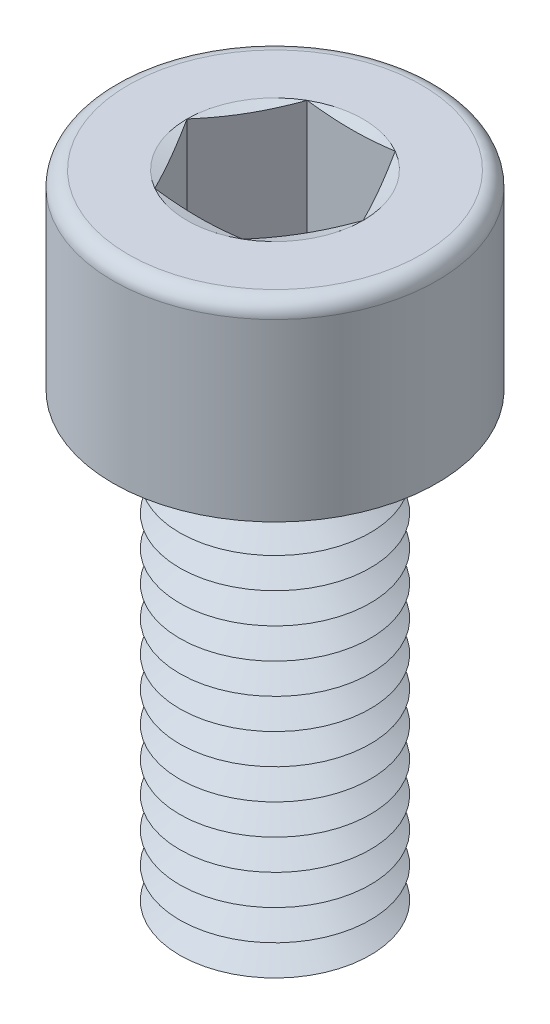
ISO-10303-21;
HEADER;
FILE_DESCRIPTION(('STEP AP214'),'2;1');
FILE_NAME('part.step','',(''),(''),'','','');
FILE_SCHEMA(('AUTOMOTIVE_DESIGN { 1 0 10303 214 1 1 1 1 }'));
ENDSEC;
DATA;
#1=APPLICATION_CONTEXT('core data for automotive mechanical design processes');
#2=APPLICATION_PROTOCOL_DEFINITION('international standard','automotive_design',2000,#1);
#3=PRODUCT_CONTEXT('',#1,'mechanical');
#4=PRODUCT('Part','Part','',(#3));
#5=PRODUCT_RELATED_PRODUCT_CATEGORY('part','',(#4));
#6=PRODUCT_DEFINITION_FORMATION('','',#4);
#7=PRODUCT_DEFINITION_CONTEXT('part definition',#1,'design');
#8=PRODUCT_DEFINITION('design','',#6,#7);
#9=PRODUCT_DEFINITION_SHAPE('','',#8);
#10=(LENGTH_UNIT() NAMED_UNIT(*) SI_UNIT(.MILLI.,.METRE.));
#11=(NAMED_UNIT(*) PLANE_ANGLE_UNIT() SI_UNIT($,.RADIAN.));
#12=(NAMED_UNIT(*) SI_UNIT($,.STERADIAN.) SOLID_ANGLE_UNIT());
#13=UNCERTAINTY_MEASURE_WITH_UNIT(LENGTH_MEASURE(1.E-05),#10,'distance_accuracy_value','');
#14=(GEOMETRIC_REPRESENTATION_CONTEXT(3) GLOBAL_UNCERTAINTY_ASSIGNED_CONTEXT((#13)) GLOBAL_UNIT_ASSIGNED_CONTEXT((#10,
#11,#12)) REPRESENTATION_CONTEXT('',''));
#15=CARTESIAN_POINT('',(0.,0.,0.));
#16=DIRECTION('',(0.,0.,1.));
#17=DIRECTION('',(1.,0.,0.));
#18=AXIS2_PLACEMENT_3D('',#15,#16,#17);
#19=CARTESIAN_POINT('',(0.,3.2,0.));
#20=DIRECTION('',(0.,1.,0.));
#21=DIRECTION('',(0.,0.,1.));
#22=AXIS2_PLACEMENT_3D('',#19,#20,#21);
#23=CONICAL_SURFACE('',#22,1.80717967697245,1.0471975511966);
#24=CARTESIAN_POINT('',(0.,3.6,0.));
#25=DIRECTION('',(0.,1.,0.));
#26=DIRECTION('',(0.,0.,1.));
#27=AXIS2_PLACEMENT_3D('',#24,#25,#26);
#28=CIRCLE('',#27,2.5);
#29=CARTESIAN_POINT('',(0.,3.6,2.5));
#30=VERTEX_POINT('',#29);
#31=EDGE_CURVE('E428',#30,#30,#28,.T.);
#32=ORIENTED_EDGE('',*,*,#31,.F.);
#33=EDGE_LOOP('',(#32));
#34=FACE_BOUND('',#33,.T.);
#35=CARTESIAN_POINT('',(0.,3.2,0.));
#36=DIRECTION('',(0.,1.,0.));
#37=DIRECTION('',(0.,0.,1.));
#38=AXIS2_PLACEMENT_3D('',#35,#36,#37);
#39=CIRCLE('',#38,1.80717967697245);
#40=CARTESIAN_POINT('',(0.,3.2,1.80717967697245));
#41=VERTEX_POINT('',#40);
#42=EDGE_CURVE('E432',#41,#41,#39,.T.);
#43=ORIENTED_EDGE('',*,*,#42,.T.);
#44=EDGE_LOOP('',(#43));
#45=FACE_BOUND('',#44,.T.);
#46=ADVANCED_FACE('F41',(#34,#45),#23,.T.);
#47=CARTESIAN_POINT('',(0.,2.8,0.));
#48=DIRECTION('',(0.,-1.,0.));
#49=DIRECTION('',(0.,0.,-1.));
#50=AXIS2_PLACEMENT_3D('',#47,#48,#49);
#51=CONICAL_SURFACE('',#50,2.5,1.0471975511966);
#52=ORIENTED_EDGE('',*,*,#42,.F.);
#53=EDGE_LOOP('',(#52));
#54=FACE_BOUND('',#53,.T.);
#55=CARTESIAN_POINT('',(0.,2.8,0.));
#56=DIRECTION('',(0.,1.,0.));
#57=DIRECTION('',(0.,0.,1.));
#58=AXIS2_PLACEMENT_3D('',#55,#56,#57);
#59=CIRCLE('',#58,2.5);
#60=CARTESIAN_POINT('',(0.,2.8,2.5));
#61=VERTEX_POINT('',#60);
#62=EDGE_CURVE('E436',#61,#61,#59,.T.);
#63=ORIENTED_EDGE('',*,*,#62,.T.);
#64=EDGE_LOOP('',(#63));
#65=FACE_BOUND('',#64,.T.);
#66=ADVANCED_FACE('F251',(#54,#65),#51,.T.);
#67=CARTESIAN_POINT('',(0.,0.,0.));
#68=DIRECTION('',(0.,1.,0.));
#69=DIRECTION('',(0.,0.,1.));
#70=AXIS2_PLACEMENT_3D('',#67,#68,#69);
#71=PLANE('',#70);
#72=CARTESIAN_POINT('',(0.,0.,0.));
#73=DIRECTION('',(0.,1.,0.));
#74=DIRECTION('',(0.,0.,1.));
#75=AXIS2_PLACEMENT_3D('',#72,#73,#74);
#76=CIRCLE('',#75,1.80717967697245);
#77=CARTESIAN_POINT('',(0.,0.,1.80717967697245));
#78=VERTEX_POINT('',#77);
#79=EDGE_CURVE('E464',#78,#78,#76,.T.);
#80=ORIENTED_EDGE('',*,*,#79,.F.);
#81=EDGE_LOOP('',(#80));
#82=FACE_BOUND('',#81,.T.);
#83=ADVANCED_FACE('F248',(#82),#71,.F.);
#84=CARTESIAN_POINT('',(0.,0.,0.));
#85=DIRECTION('',(0.,1.,0.));
#86=DIRECTION('',(0.,0.,1.));
#87=AXIS2_PLACEMENT_3D('',#84,#85,#86);
#88=CONICAL_SURFACE('',#87,1.80717967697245,1.0471975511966);
#89=CARTESIAN_POINT('',(0.,0.400000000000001,0.));
#90=DIRECTION('',(0.,1.,0.));
#91=DIRECTION('',(0.,0.,1.));
#92=AXIS2_PLACEMENT_3D('',#89,#90,#91);
#93=CIRCLE('',#92,2.5);
#94=CARTESIAN_POINT('',(0.,0.400000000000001,2.5));
#95=VERTEX_POINT('',#94);
#96=EDGE_CURVE('E460',#95,#95,#93,.T.);
#97=ORIENTED_EDGE('',*,*,#96,.F.);
#98=EDGE_LOOP('',(#97));
#99=FACE_BOUND('',#98,.T.);
#100=ORIENTED_EDGE('',*,*,#79,.T.);
#101=EDGE_LOOP('',(#100));
#102=FACE_BOUND('',#101,.T.);
#103=ADVANCED_FACE('F250',(#99,#102),#88,.T.);
#104=CARTESIAN_POINT('',(0.,0.400000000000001,0.));
#105=DIRECTION('',(0.,-1.,0.));
#106=DIRECTION('',(0.,0.,-1.));
#107=AXIS2_PLACEMENT_3D('',#104,#105,#106);
#108=CONICAL_SURFACE('',#107,2.5,1.0471975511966);
#109=CARTESIAN_POINT('',(0.,0.8,0.));
#110=DIRECTION('',(0.,1.,0.));
#111=DIRECTION('',(0.,0.,1.));
#112=AXIS2_PLACEMENT_3D('',#109,#110,#111);
#113=CIRCLE('',#112,1.80717967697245);
#114=CARTESIAN_POINT('',(0.,0.8,1.80717967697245));
#115=VERTEX_POINT('',#114);
#116=EDGE_CURVE('E456',#115,#115,#113,.T.);
#117=ORIENTED_EDGE('',*,*,#116,.F.);
#118=EDGE_LOOP('',(#117));
#119=FACE_BOUND('',#118,.T.);
#120=ORIENTED_EDGE('',*,*,#96,.T.);
#121=EDGE_LOOP('',(#120));
#122=FACE_BOUND('',#121,.T.);
#123=ADVANCED_FACE('F291',(#119,#122),#108,.T.);
#124=CARTESIAN_POINT('',(0.,0.8,0.));
#125=DIRECTION('',(0.,1.,0.));
#126=DIRECTION('',(0.,0.,1.));
#127=AXIS2_PLACEMENT_3D('',#124,#125,#126);
#128=CONICAL_SURFACE('',#127,1.80717967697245,1.0471975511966);
#129=CARTESIAN_POINT('',(0.,1.2,0.));
#130=DIRECTION('',(0.,1.,0.));
#131=DIRECTION('',(0.,0.,1.));
#132=AXIS2_PLACEMENT_3D('',#129,#130,#131);
#133=CIRCLE('',#132,2.5);
#134=CARTESIAN_POINT('',(0.,1.2,2.5));
#135=VERTEX_POINT('',#134);
#136=EDGE_CURVE('E452',#135,#135,#133,.T.);
#137=ORIENTED_EDGE('',*,*,#136,.F.);
#138=EDGE_LOOP('',(#137));
#139=FACE_BOUND('',#138,.T.);
#140=ORIENTED_EDGE('',*,*,#116,.T.);
#141=EDGE_LOOP('',(#140));
#142=FACE_BOUND('',#141,.T.);
#143=ADVANCED_FACE('F286',(#139,#142),#128,.T.);
#144=CARTESIAN_POINT('',(0.,1.2,0.));
#145=DIRECTION('',(0.,-1.,0.));
#146=DIRECTION('',(0.,0.,-1.));
#147=AXIS2_PLACEMENT_3D('',#144,#145,#146);
#148=CONICAL_SURFACE('',#147,2.5,1.0471975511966);
#149=CARTESIAN_POINT('',(0.,1.6,0.));
#150=DIRECTION('',(0.,1.,0.));
#151=DIRECTION('',(0.,0.,1.));
#152=AXIS2_PLACEMENT_3D('',#149,#150,#151);
#153=CIRCLE('',#152,1.80717967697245);
#154=CARTESIAN_POINT('',(0.,1.6,1.80717967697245));
#155=VERTEX_POINT('',#154);
#156=EDGE_CURVE('E448',#155,#155,#153,.T.);
#157=ORIENTED_EDGE('',*,*,#156,.F.);
#158=EDGE_LOOP('',(#157));
#159=FACE_BOUND('',#158,.T.);
#160=ORIENTED_EDGE('',*,*,#136,.T.);
#161=EDGE_LOOP('',(#160));
#162=FACE_BOUND('',#161,.T.);
#163=ADVANCED_FACE('F283',(#159,#162),#148,.T.);
#164=CARTESIAN_POINT('',(0.,1.6,0.));
#165=DIRECTION('',(0.,1.,0.));
#166=DIRECTION('',(0.,0.,1.));
#167=AXIS2_PLACEMENT_3D('',#164,#165,#166);
#168=CONICAL_SURFACE('',#167,1.80717967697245,1.0471975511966);
#169=CARTESIAN_POINT('',(0.,2.,0.));
#170=DIRECTION('',(0.,1.,0.));
#171=DIRECTION('',(0.,0.,1.));
#172=AXIS2_PLACEMENT_3D('',#169,#170,#171);
#173=CIRCLE('',#172,2.5);
#174=CARTESIAN_POINT('',(0.,2.,2.5));
#175=VERTEX_POINT('',#174);
#176=EDGE_CURVE('E444',#175,#175,#173,.T.);
#177=ORIENTED_EDGE('',*,*,#176,.F.);
#178=EDGE_LOOP('',(#177));
#179=FACE_BOUND('',#178,.T.);
#180=ORIENTED_EDGE('',*,*,#156,.T.);
#181=EDGE_LOOP('',(#180));
#182=FACE_BOUND('',#181,.T.);
#183=ADVANCED_FACE('F277',(#179,#182),#168,.T.);
#184=CARTESIAN_POINT('',(0.,2.,0.));
#185=DIRECTION('',(0.,-1.,0.));
#186=DIRECTION('',(0.,0.,-1.));
#187=AXIS2_PLACEMENT_3D('',#184,#185,#186);
#188=CONICAL_SURFACE('',#187,2.5,1.0471975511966);
#189=CARTESIAN_POINT('',(0.,2.4,0.));
#190=DIRECTION('',(0.,1.,0.));
#191=DIRECTION('',(0.,0.,1.));
#192=AXIS2_PLACEMENT_3D('',#189,#190,#191);
#193=CIRCLE('',#192,1.80717967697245);
#194=CARTESIAN_POINT('',(0.,2.4,1.80717967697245));
#195=VERTEX_POINT('',#194);
#196=EDGE_CURVE('E440',#195,#195,#193,.T.);
#197=ORIENTED_EDGE('',*,*,#196,.F.);
#198=EDGE_LOOP('',(#197));
#199=FACE_BOUND('',#198,.T.);
#200=ORIENTED_EDGE('',*,*,#176,.T.);
#201=EDGE_LOOP('',(#200));
#202=FACE_BOUND('',#201,.T.);
#203=ADVANCED_FACE('F273',(#199,#202),#188,.T.);
#204=CARTESIAN_POINT('',(0.,2.4,0.));
#205=DIRECTION('',(0.,1.,0.));
#206=DIRECTION('',(0.,0.,1.));
#207=AXIS2_PLACEMENT_3D('',#204,#205,#206);
#208=CONICAL_SURFACE('',#207,1.80717967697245,1.0471975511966);
#209=ORIENTED_EDGE('',*,*,#62,.F.);
#210=EDGE_LOOP('',(#209));
#211=FACE_BOUND('',#210,.T.);
#212=ORIENTED_EDGE('',*,*,#196,.T.);
#213=EDGE_LOOP('',(#212));
#214=FACE_BOUND('',#213,.T.);
#215=ADVANCED_FACE('F276',(#211,#214),#208,.T.);
#216=CARTESIAN_POINT('',(0.,4.,0.));
#217=DIRECTION('',(0.,1.,0.));
#218=DIRECTION('',(0.,0.,1.));
#219=AXIS2_PLACEMENT_3D('',#216,#217,#218);
#220=CONICAL_SURFACE('',#219,1.80717967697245,1.0471975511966);
#221=CARTESIAN_POINT('',(0.,4.4,0.));
#222=DIRECTION('',(0.,1.,0.));
#223=DIRECTION('',(0.,0.,1.));
#224=AXIS2_PLACEMENT_3D('',#221,#222,#223);
#225=CIRCLE('',#224,2.5);
#226=CARTESIAN_POINT('',(0.,4.4,2.5));
#227=VERTEX_POINT('',#226);
#228=EDGE_CURVE('E420',#227,#227,#225,.T.);
#229=ORIENTED_EDGE('',*,*,#228,.F.);
#230=EDGE_LOOP('',(#229));
#231=FACE_BOUND('',#230,.T.);
#232=CARTESIAN_POINT('',(0.,4.,0.));
#233=DIRECTION('',(0.,1.,0.));
#234=DIRECTION('',(0.,0.,1.));
#235=AXIS2_PLACEMENT_3D('',#232,#233,#234);
#236=CIRCLE('',#235,1.80717967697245);
#237=CARTESIAN_POINT('',(0.,4.,1.80717967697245));
#238=VERTEX_POINT('',#237);
#239=EDGE_CURVE('E424',#238,#238,#236,.T.);
#240=ORIENTED_EDGE('',*,*,#239,.T.);
#241=EDGE_LOOP('',(#240));
#242=FACE_BOUND('',#241,.T.);
#243=ADVANCED_FACE('F281',(#231,#242),#220,.T.);
#244=CARTESIAN_POINT('',(0.,3.6,0.));
#245=DIRECTION('',(0.,-1.,0.));
#246=DIRECTION('',(0.,0.,-1.));
#247=AXIS2_PLACEMENT_3D('',#244,#245,#246);
#248=CONICAL_SURFACE('',#247,2.5,1.0471975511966);
#249=ORIENTED_EDGE('',*,*,#239,.F.);
#250=EDGE_LOOP('',(#249));
#251=FACE_BOUND('',#250,.T.);
#252=ORIENTED_EDGE('',*,*,#31,.T.);
#253=EDGE_LOOP('',(#252));
#254=FACE_BOUND('',#253,.T.);
#255=ADVANCED_FACE('F696',(#251,#254),#248,.T.);
#256=CARTESIAN_POINT('',(0.,4.8,0.));
#257=DIRECTION('',(0.,1.,0.));
#258=DIRECTION('',(0.,0.,1.));
#259=AXIS2_PLACEMENT_3D('',#256,#257,#258);
#260=CONICAL_SURFACE('',#259,1.80717967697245,1.0471975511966);
#261=CARTESIAN_POINT('',(0.,5.2,0.));
#262=DIRECTION('',(0.,1.,0.));
#263=DIRECTION('',(0.,0.,1.));
#264=AXIS2_PLACEMENT_3D('',#261,#262,#263);
#265=CIRCLE('',#264,2.5);
#266=CARTESIAN_POINT('',(0.,5.2,2.5));
#267=VERTEX_POINT('',#266);
#268=EDGE_CURVE('E413',#267,#267,#265,.T.);
#269=ORIENTED_EDGE('',*,*,#268,.F.);
#270=EDGE_LOOP('',(#269));
#271=FACE_BOUND('',#270,.T.);
#272=CARTESIAN_POINT('',(0.,4.8,0.));
#273=DIRECTION('',(0.,1.,0.));
#274=DIRECTION('',(0.,0.,1.));
#275=AXIS2_PLACEMENT_3D('',#272,#273,#274);
#276=CIRCLE('',#275,1.80717967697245);
#277=CARTESIAN_POINT('',(0.,4.8,1.80717967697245));
#278=VERTEX_POINT('',#277);
#279=EDGE_CURVE('E416',#278,#278,#276,.T.);
#280=ORIENTED_EDGE('',*,*,#279,.T.);
#281=EDGE_LOOP('',(#280));
#282=FACE_BOUND('',#281,.T.);
#283=ADVANCED_FACE('F705',(#271,#282),#260,.T.);
#284=CARTESIAN_POINT('',(0.,4.4,0.));
#285=DIRECTION('',(0.,-1.,0.));
#286=DIRECTION('',(0.,0.,-1.));
#287=AXIS2_PLACEMENT_3D('',#284,#285,#286);
#288=CONICAL_SURFACE('',#287,2.5,1.0471975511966);
#289=ORIENTED_EDGE('',*,*,#279,.F.);
#290=EDGE_LOOP('',(#289));
#291=FACE_BOUND('',#290,.T.);
#292=ORIENTED_EDGE('',*,*,#228,.T.);
#293=EDGE_LOOP('',(#292));
#294=FACE_BOUND('',#293,.T.);
#295=ADVANCED_FACE('F715',(#291,#294),#288,.T.);
#296=CARTESIAN_POINT('',(0.,5.6,0.));
#297=DIRECTION('',(0.,1.,0.));
#298=DIRECTION('',(0.,0.,1.));
#299=AXIS2_PLACEMENT_3D('',#296,#297,#298);
#300=CONICAL_SURFACE('',#299,1.80717967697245,1.0471975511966);
#301=CARTESIAN_POINT('',(0.,6.,0.));
#302=DIRECTION('',(0.,1.,0.));
#303=DIRECTION('',(0.,0.,1.));
#304=AXIS2_PLACEMENT_3D('',#301,#302,#303);
#305=CIRCLE('',#304,2.5);
#306=CARTESIAN_POINT('',(0.,6.,2.5));
#307=VERTEX_POINT('',#306);
#308=EDGE_CURVE('E405',#307,#307,#305,.T.);
#309=ORIENTED_EDGE('',*,*,#308,.F.);
#310=EDGE_LOOP('',(#309));
#311=FACE_BOUND('',#310,.T.);
#312=CARTESIAN_POINT('',(0.,5.6,0.));
#313=DIRECTION('',(0.,1.,0.));
#314=DIRECTION('',(0.,0.,1.));
#315=AXIS2_PLACEMENT_3D('',#312,#313,#314);
#316=CIRCLE('',#315,1.80717967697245);
#317=CARTESIAN_POINT('',(0.,5.6,1.80717967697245));
#318=VERTEX_POINT('',#317);
#319=EDGE_CURVE('E409',#318,#318,#316,.T.);
#320=ORIENTED_EDGE('',*,*,#319,.T.);
#321=EDGE_LOOP('',(#320));
#322=FACE_BOUND('',#321,.T.);
#323=ADVANCED_FACE('F725',(#311,#322),#300,.T.);
#324=CARTESIAN_POINT('',(0.,5.2,0.));
#325=DIRECTION('',(0.,-1.,0.));
#326=DIRECTION('',(0.,0.,-1.));
#327=AXIS2_PLACEMENT_3D('',#324,#325,#326);
#328=CONICAL_SURFACE('',#327,2.5,1.0471975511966);
#329=ORIENTED_EDGE('',*,*,#319,.F.);
#330=EDGE_LOOP('',(#329));
#331=FACE_BOUND('',#330,.T.);
#332=ORIENTED_EDGE('',*,*,#268,.T.);
#333=EDGE_LOOP('',(#332));
#334=FACE_BOUND('',#333,.T.);
#335=ADVANCED_FACE('F735',(#331,#334),#328,.T.);
#336=CARTESIAN_POINT('',(0.,6.4,0.));
#337=DIRECTION('',(0.,1.,0.));
#338=DIRECTION('',(0.,0.,1.));
#339=AXIS2_PLACEMENT_3D('',#336,#337,#338);
#340=CONICAL_SURFACE('',#339,1.80717967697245,1.0471975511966);
#341=CARTESIAN_POINT('',(0.,6.8,0.));
#342=DIRECTION('',(0.,1.,0.));
#343=DIRECTION('',(0.,0.,1.));
#344=AXIS2_PLACEMENT_3D('',#341,#342,#343);
#345=CIRCLE('',#344,2.5);
#346=CARTESIAN_POINT('',(0.,6.8,2.5));
#347=VERTEX_POINT('',#346);
#348=EDGE_CURVE('E397',#347,#347,#345,.T.);
#349=ORIENTED_EDGE('',*,*,#348,.F.);
#350=EDGE_LOOP('',(#349));
#351=FACE_BOUND('',#350,.T.);
#352=CARTESIAN_POINT('',(0.,6.4,0.));
#353=DIRECTION('',(0.,1.,0.));
#354=DIRECTION('',(0.,0.,1.));
#355=AXIS2_PLACEMENT_3D('',#352,#353,#354);
#356=CIRCLE('',#355,1.80717967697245);
#357=CARTESIAN_POINT('',(0.,6.4,1.80717967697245));
#358=VERTEX_POINT('',#357);
#359=EDGE_CURVE('E401',#358,#358,#356,.T.);
#360=ORIENTED_EDGE('',*,*,#359,.T.);
#361=EDGE_LOOP('',(#360));
#362=FACE_BOUND('',#361,.T.);
#363=ADVANCED_FACE('F745',(#351,#362),#340,.T.);
#364=CARTESIAN_POINT('',(0.,6.,0.));
#365=DIRECTION('',(0.,-1.,0.));
#366=DIRECTION('',(0.,0.,-1.));
#367=AXIS2_PLACEMENT_3D('',#364,#365,#366);
#368=CONICAL_SURFACE('',#367,2.5,1.0471975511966);
#369=ORIENTED_EDGE('',*,*,#359,.F.);
#370=EDGE_LOOP('',(#369));
#371=FACE_BOUND('',#370,.T.);
#372=ORIENTED_EDGE('',*,*,#308,.T.);
#373=EDGE_LOOP('',(#372));
#374=FACE_BOUND('',#373,.T.);
#375=ADVANCED_FACE('F755',(#371,#374),#368,.T.);
#376=CARTESIAN_POINT('',(0.,7.2,0.));
#377=DIRECTION('',(0.,1.,0.));
#378=DIRECTION('',(0.,0.,1.));
#379=AXIS2_PLACEMENT_3D('',#376,#377,#378);
#380=CONICAL_SURFACE('',#379,1.80717967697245,1.0471975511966);
#381=CARTESIAN_POINT('',(0.,7.6,0.));
#382=DIRECTION('',(0.,1.,0.));
#383=DIRECTION('',(0.,0.,1.));
#384=AXIS2_PLACEMENT_3D('',#381,#382,#383);
#385=CIRCLE('',#384,2.5);
#386=CARTESIAN_POINT('',(0.,7.6,2.5));
#387=VERTEX_POINT('',#386);
#388=EDGE_CURVE('E390',#387,#387,#385,.T.);
#389=ORIENTED_EDGE('',*,*,#388,.F.);
#390=EDGE_LOOP('',(#389));
#391=FACE_BOUND('',#390,.T.);
#392=CARTESIAN_POINT('',(0.,7.2,0.));
#393=DIRECTION('',(0.,1.,0.));
#394=DIRECTION('',(0.,0.,1.));
#395=AXIS2_PLACEMENT_3D('',#392,#393,#394);
#396=CIRCLE('',#395,1.80717967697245);
#397=CARTESIAN_POINT('',(0.,7.2,1.80717967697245));
#398=VERTEX_POINT('',#397);
#399=EDGE_CURVE('E394',#398,#398,#396,.T.);
#400=ORIENTED_EDGE('',*,*,#399,.T.);
#401=EDGE_LOOP('',(#400));
#402=FACE_BOUND('',#401,.T.);
#403=ADVANCED_FACE('F765',(#391,#402),#380,.T.);
#404=CARTESIAN_POINT('',(0.,6.8,0.));
#405=DIRECTION('',(0.,-1.,0.));
#406=DIRECTION('',(0.,0.,-1.));
#407=AXIS2_PLACEMENT_3D('',#404,#405,#406);
#408=CONICAL_SURFACE('',#407,2.5,1.0471975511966);
#409=ORIENTED_EDGE('',*,*,#399,.F.);
#410=EDGE_LOOP('',(#409));
#411=FACE_BOUND('',#410,.T.);
#412=ORIENTED_EDGE('',*,*,#348,.T.);
#413=EDGE_LOOP('',(#412));
#414=FACE_BOUND('',#413,.T.);
#415=ADVANCED_FACE('F775',(#411,#414),#408,.T.);
#416=CARTESIAN_POINT('',(0.,8.,0.));
#417=DIRECTION('',(0.,1.,0.));
#418=DIRECTION('',(0.,0.,1.));
#419=AXIS2_PLACEMENT_3D('',#416,#417,#418);
#420=CONICAL_SURFACE('',#419,1.80717967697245,1.0471975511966);
#421=CARTESIAN_POINT('',(0.,8.4,0.));
#422=DIRECTION('',(0.,1.,0.));
#423=DIRECTION('',(0.,0.,1.));
#424=AXIS2_PLACEMENT_3D('',#421,#422,#423);
#425=CIRCLE('',#424,2.5);
#426=CARTESIAN_POINT('',(0.,8.4,2.5));
#427=VERTEX_POINT('',#426);
#428=EDGE_CURVE('E382',#427,#427,#425,.T.);
#429=ORIENTED_EDGE('',*,*,#428,.F.);
#430=EDGE_LOOP('',(#429));
#431=FACE_BOUND('',#430,.T.);
#432=CARTESIAN_POINT('',(0.,8.,0.));
#433=DIRECTION('',(0.,1.,0.));
#434=DIRECTION('',(0.,0.,1.));
#435=AXIS2_PLACEMENT_3D('',#432,#433,#434);
#436=CIRCLE('',#435,1.80717967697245);
#437=CARTESIAN_POINT('',(0.,8.,1.80717967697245));
#438=VERTEX_POINT('',#437);
#439=EDGE_CURVE('E386',#438,#438,#436,.T.);
#440=ORIENTED_EDGE('',*,*,#439,.T.);
#441=EDGE_LOOP('',(#440));
#442=FACE_BOUND('',#441,.T.);
#443=ADVANCED_FACE('F785',(#431,#442),#420,.T.);
#444=CARTESIAN_POINT('',(0.,7.6,0.));
#445=DIRECTION('',(0.,-1.,0.));
#446=DIRECTION('',(0.,0.,-1.));
#447=AXIS2_PLACEMENT_3D('',#444,#445,#446);
#448=CONICAL_SURFACE('',#447,2.5,1.0471975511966);
#449=ORIENTED_EDGE('',*,*,#439,.F.);
#450=EDGE_LOOP('',(#449));
#451=FACE_BOUND('',#450,.T.);
#452=ORIENTED_EDGE('',*,*,#388,.T.);
#453=EDGE_LOOP('',(#452));
#454=FACE_BOUND('',#453,.T.);
#455=ADVANCED_FACE('F795',(#451,#454),#448,.T.);
#456=CARTESIAN_POINT('',(0.,8.8,0.));
#457=DIRECTION('',(0.,1.,0.));
#458=DIRECTION('',(0.,0.,1.));
#459=AXIS2_PLACEMENT_3D('',#456,#457,#458);
#460=CONICAL_SURFACE('',#459,1.80717967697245,1.0471975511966);
#461=CARTESIAN_POINT('',(0.,9.2,0.));
#462=DIRECTION('',(0.,1.,0.));
#463=DIRECTION('',(0.,0.,1.));
#464=AXIS2_PLACEMENT_3D('',#461,#462,#463);
#465=CIRCLE('',#464,2.5);
#466=CARTESIAN_POINT('',(0.,9.2,2.5));
#467=VERTEX_POINT('',#466);
#468=EDGE_CURVE('E375',#467,#467,#465,.T.);
#469=ORIENTED_EDGE('',*,*,#468,.F.);
#470=EDGE_LOOP('',(#469));
#471=FACE_BOUND('',#470,.T.);
#472=CARTESIAN_POINT('',(0.,8.8,0.));
#473=DIRECTION('',(0.,1.,0.));
#474=DIRECTION('',(0.,0.,1.));
#475=AXIS2_PLACEMENT_3D('',#472,#473,#474);
#476=CIRCLE('',#475,1.80717967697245);
#477=CARTESIAN_POINT('',(0.,8.8,1.80717967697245));
#478=VERTEX_POINT('',#477);
#479=EDGE_CURVE('E379',#478,#478,#476,.T.);
#480=ORIENTED_EDGE('',*,*,#479,.T.);
#481=EDGE_LOOP('',(#480));
#482=FACE_BOUND('',#481,.T.);
#483=ADVANCED_FACE('F805',(#471,#482),#460,.T.);
#484=CARTESIAN_POINT('',(0.,8.4,0.));
#485=DIRECTION('',(0.,-1.,0.));
#486=DIRECTION('',(0.,0.,-1.));
#487=AXIS2_PLACEMENT_3D('',#484,#485,#486);
#488=CONICAL_SURFACE('',#487,2.5,1.0471975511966);
#489=ORIENTED_EDGE('',*,*,#479,.F.);
#490=EDGE_LOOP('',(#489));
#491=FACE_BOUND('',#490,.T.);
#492=ORIENTED_EDGE('',*,*,#428,.T.);
#493=EDGE_LOOP('',(#492));
#494=FACE_BOUND('',#493,.T.);
#495=ADVANCED_FACE('F815',(#491,#494),#488,.T.);
#496=CARTESIAN_POINT('',(0.,9.6,0.));
#497=DIRECTION('',(0.,1.,0.));
#498=DIRECTION('',(0.,0.,1.));
#499=AXIS2_PLACEMENT_3D('',#496,#497,#498);
#500=CONICAL_SURFACE('',#499,1.80717967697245,1.0471975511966);
#501=CARTESIAN_POINT('',(0.,10.,0.));
#502=DIRECTION('',(0.,1.,0.));
#503=DIRECTION('',(0.,0.,1.));
#504=AXIS2_PLACEMENT_3D('',#501,#502,#503);
#505=CIRCLE('',#504,2.5);
#506=CARTESIAN_POINT('',(0.,10.,2.5));
#507=VERTEX_POINT('',#506);
#508=EDGE_CURVE('E367',#507,#507,#505,.T.);
#509=ORIENTED_EDGE('',*,*,#508,.F.);
#510=EDGE_LOOP('',(#509));
#511=FACE_BOUND('',#510,.T.);
#512=CARTESIAN_POINT('',(0.,9.6,0.));
#513=DIRECTION('',(0.,1.,0.));
#514=DIRECTION('',(0.,0.,1.));
#515=AXIS2_PLACEMENT_3D('',#512,#513,#514);
#516=CIRCLE('',#515,1.80717967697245);
#517=CARTESIAN_POINT('',(0.,9.6,1.80717967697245));
#518=VERTEX_POINT('',#517);
#519=EDGE_CURVE('E371',#518,#518,#516,.T.);
#520=ORIENTED_EDGE('',*,*,#519,.T.);
#521=EDGE_LOOP('',(#520));
#522=FACE_BOUND('',#521,.T.);
#523=ADVANCED_FACE('F825',(#511,#522),#500,.T.);
#524=CARTESIAN_POINT('',(0.,9.2,0.));
#525=DIRECTION('',(0.,-1.,0.));
#526=DIRECTION('',(0.,0.,-1.));
#527=AXIS2_PLACEMENT_3D('',#524,#525,#526);
#528=CONICAL_SURFACE('',#527,2.5,1.0471975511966);
#529=ORIENTED_EDGE('',*,*,#519,.F.);
#530=EDGE_LOOP('',(#529));
#531=FACE_BOUND('',#530,.T.);
#532=ORIENTED_EDGE('',*,*,#468,.T.);
#533=EDGE_LOOP('',(#532));
#534=FACE_BOUND('',#533,.T.);
#535=ADVANCED_FACE('F835',(#531,#534),#528,.T.);
#536=CARTESIAN_POINT('',(0.,10.4,0.));
#537=DIRECTION('',(0.,1.,0.));
#538=DIRECTION('',(0.,0.,1.));
#539=AXIS2_PLACEMENT_3D('',#536,#537,#538);
#540=CONICAL_SURFACE('',#539,1.80717967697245,1.0471975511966);
#541=CARTESIAN_POINT('',(0.,10.8,0.));
#542=DIRECTION('',(0.,1.,0.));
#543=DIRECTION('',(0.,0.,1.));
#544=AXIS2_PLACEMENT_3D('',#541,#542,#543);
#545=CIRCLE('',#544,2.5);
#546=CARTESIAN_POINT('',(0.,10.8,2.5));
#547=VERTEX_POINT('',#546);
#548=EDGE_CURVE('E352',#547,#547,#545,.T.);
#549=ORIENTED_EDGE('',*,*,#548,.F.);
#550=EDGE_LOOP('',(#549));
#551=FACE_BOUND('',#550,.T.);
#552=CARTESIAN_POINT('',(0.,10.4,0.));
#553=DIRECTION('',(0.,1.,0.));
#554=DIRECTION('',(0.,0.,1.));
#555=AXIS2_PLACEMENT_3D('',#552,#553,#554);
#556=CIRCLE('',#555,1.80717967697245);
#557=CARTESIAN_POINT('',(0.,10.4,1.80717967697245));
#558=VERTEX_POINT('',#557);
#559=EDGE_CURVE('E363',#558,#558,#556,.T.);
#560=ORIENTED_EDGE('',*,*,#559,.T.);
#561=EDGE_LOOP('',(#560));
#562=FACE_BOUND('',#561,.T.);
#563=ADVANCED_FACE('F845',(#551,#562),#540,.T.);
#564=CARTESIAN_POINT('',(0.,10.,0.));
#565=DIRECTION('',(0.,-1.,0.));
#566=DIRECTION('',(0.,0.,-1.));
#567=AXIS2_PLACEMENT_3D('',#564,#565,#566);
#568=CONICAL_SURFACE('',#567,2.5,1.0471975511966);
#569=ORIENTED_EDGE('',*,*,#559,.F.);
#570=EDGE_LOOP('',(#569));
#571=FACE_BOUND('',#570,.T.);
#572=ORIENTED_EDGE('',*,*,#508,.T.);
#573=EDGE_LOOP('',(#572));
#574=FACE_BOUND('',#573,.T.);
#575=ADVANCED_FACE('F855',(#571,#574),#568,.T.);
#576=CARTESIAN_POINT('',(0.,11.2,0.));
#577=DIRECTION('',(0.,1.,0.));
#578=DIRECTION('',(0.,0.,1.));
#579=AXIS2_PLACEMENT_3D('',#576,#577,#578);
#580=CONICAL_SURFACE('',#579,1.80717967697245,1.0471975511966);
#581=CARTESIAN_POINT('',(0.,11.6,0.));
#582=DIRECTION('',(0.,1.,0.));
#583=DIRECTION('',(0.,0.,1.));
#584=AXIS2_PLACEMENT_3D('',#581,#582,#583);
#585=CIRCLE('',#584,2.5);
#586=CARTESIAN_POINT('',(0.,11.6,2.5));
#587=VERTEX_POINT('',#586);
#588=EDGE_CURVE('E358',#587,#587,#585,.T.);
#589=ORIENTED_EDGE('',*,*,#588,.F.);
#590=EDGE_LOOP('',(#589));
#591=FACE_BOUND('',#590,.T.);
#592=CARTESIAN_POINT('',(0.,11.2,0.));
#593=DIRECTION('',(0.,1.,0.));
#594=DIRECTION('',(0.,0.,1.));
#595=AXIS2_PLACEMENT_3D('',#592,#593,#594);
#596=CIRCLE('',#595,1.80717967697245);
#597=CARTESIAN_POINT('',(0.,11.2,1.80717967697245));
#598=VERTEX_POINT('',#597);
#599=EDGE_CURVE('E348',#598,#598,#596,.T.);
#600=ORIENTED_EDGE('',*,*,#599,.T.);
#601=EDGE_LOOP('',(#600));
#602=FACE_BOUND('',#601,.T.);
#603=ADVANCED_FACE('F865',(#591,#602),#580,.T.);
#604=CARTESIAN_POINT('',(0.,10.8,0.));
#605=DIRECTION('',(0.,-1.,0.));
#606=DIRECTION('',(0.,0.,-1.));
#607=AXIS2_PLACEMENT_3D('',#604,#605,#606);
#608=CONICAL_SURFACE('',#607,2.5,1.0471975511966);
#609=ORIENTED_EDGE('',*,*,#599,.F.);
#610=EDGE_LOOP('',(#609));
#611=FACE_BOUND('',#610,.T.);
#612=ORIENTED_EDGE('',*,*,#548,.T.);
#613=EDGE_LOOP('',(#612));
#614=FACE_BOUND('',#613,.T.);
#615=ADVANCED_FACE('F195',(#611,#614),#608,.T.);
#616=CARTESIAN_POINT('',(0.,17.,0.));
#617=DIRECTION('',(0.,1.,0.));
#618=DIRECTION('',(0.,0.,1.));
#619=AXIS2_PLACEMENT_3D('',#616,#617,#618);
#620=PLANE('',#619);
#621=CARTESIAN_POINT('',(0.,17.,0.));
#622=DIRECTION('',(0.,1.,0.));
#623=DIRECTION('',(0.,0.,1.));
#624=AXIS2_PLACEMENT_3D('',#621,#622,#623);
#625=CIRCLE('',#624,2.3094010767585);
#626=CARTESIAN_POINT('',(1.15470053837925,17.,2.));
#627=VERTEX_POINT('',#626);
#628=CARTESIAN_POINT('',(2.3094010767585,17.,0.));
#629=VERTEX_POINT('',#628);
#630=EDGE_CURVE('E121',#627,#629,#625,.T.);
#631=ORIENTED_EDGE('',*,*,#630,.F.);
#632=CARTESIAN_POINT('',(0.,17.,0.));
#633=DIRECTION('',(0.,1.,0.));
#634=DIRECTION('',(0.,0.,1.));
#635=AXIS2_PLACEMENT_3D('',#632,#633,#634);
#636=CIRCLE('',#635,2.3094010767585);
#637=CARTESIAN_POINT('',(-1.15470053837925,17.,2.));
#638=VERTEX_POINT('',#637);
#639=EDGE_CURVE('E45',#638,#627,#636,.T.);
#640=ORIENTED_EDGE('',*,*,#639,.F.);
#641=CARTESIAN_POINT('',(-2.3094010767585,17.,0.));
#642=VERTEX_POINT('',#641);
#643=EDGE_CURVE('E138',#642,#638,#636,.T.);
#644=ORIENTED_EDGE('',*,*,#643,.F.);
#645=CARTESIAN_POINT('',(-1.15470053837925,17.,-2.));
#646=VERTEX_POINT('',#645);
#647=EDGE_CURVE('E1003',#646,#642,#636,.T.);
#648=ORIENTED_EDGE('',*,*,#647,.F.);
#649=CARTESIAN_POINT('',(1.15470053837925,17.,-2.));
#650=VERTEX_POINT('',#649);
#651=EDGE_CURVE('E51',#650,#646,#636,.T.);
#652=ORIENTED_EDGE('',*,*,#651,.F.);
#653=EDGE_CURVE('E11',#629,#650,#636,.T.);
#654=ORIENTED_EDGE('',*,*,#653,.F.);
#655=EDGE_LOOP('',(#631,#640,#644,#648,#652,#654));
#656=FACE_BOUND('',#655,.T.);
#657=CARTESIAN_POINT('',(0.,17.,0.));
#658=DIRECTION('',(0.,1.,0.));
#659=DIRECTION('',(0.,0.,1.));
#660=AXIS2_PLACEMENT_3D('',#657,#658,#659);
#661=CIRCLE('',#660,3.85);
#662=CARTESIAN_POINT('',(0.,17.,3.85));
#663=VERTEX_POINT('',#662);
#664=EDGE_CURVE('E508',#663,#663,#661,.T.);
#665=ORIENTED_EDGE('',*,*,#664,.T.);
#666=EDGE_LOOP('',(#665));
#667=FACE_BOUND('',#666,.T.);
#668=ADVANCED_FACE('F140',(#656,#667),#620,.T.);
#669=CARTESIAN_POINT('',(0.,16.6,0.));
#670=DIRECTION('',(0.,1.,0.));
#671=DIRECTION('',(0.,0.,1.));
#672=AXIS2_PLACEMENT_3D('',#669,#670,#671);
#673=TOROIDAL_SURFACE('',#672,3.85,0.4);
#674=CARTESIAN_POINT('',(0.,16.6,0.));
#675=DIRECTION('',(0.,1.,0.));
#676=DIRECTION('',(0.,0.,1.));
#677=AXIS2_PLACEMENT_3D('',#674,#675,#676);
#678=CIRCLE('',#677,4.25);
#679=CARTESIAN_POINT('',(0.,16.6,4.25));
#680=VERTEX_POINT('',#679);
#681=EDGE_CURVE('E512',#680,#680,#678,.F.);
#682=ORIENTED_EDGE('',*,*,#681,.F.);
#683=EDGE_LOOP('',(#682));
#684=FACE_BOUND('',#683,.T.);
#685=ORIENTED_EDGE('',*,*,#664,.F.);
#686=EDGE_LOOP('',(#685));
#687=FACE_BOUND('',#686,.T.);
#688=ADVANCED_FACE('F43',(#684,#687),#673,.T.);
#689=CARTESIAN_POINT('',(0.,17.,0.));
#690=DIRECTION('',(0.,-1.,0.));
#691=DIRECTION('',(0.,0.,-1.));
#692=AXIS2_PLACEMENT_3D('',#689,#690,#691);
#693=CYLINDRICAL_SURFACE('',#692,4.25);
#694=ORIENTED_EDGE('',*,*,#681,.T.);
#695=EDGE_LOOP('',(#694));
#696=FACE_BOUND('',#695,.T.);
#697=CARTESIAN_POINT('',(0.,12.,0.));
#698=DIRECTION('',(0.,1.,0.));
#699=DIRECTION('',(0.,0.,1.));
#700=AXIS2_PLACEMENT_3D('',#697,#698,#699);
#701=CIRCLE('',#700,4.25);
#702=CARTESIAN_POINT('',(0.,12.,4.25));
#703=VERTEX_POINT('',#702);
#704=EDGE_CURVE('E495',#703,#703,#701,.T.);
#705=ORIENTED_EDGE('',*,*,#704,.T.);
#706=EDGE_LOOP('',(#705));
#707=FACE_BOUND('',#706,.T.);
#708=ADVANCED_FACE('F243',(#696,#707),#693,.T.);
#709=CARTESIAN_POINT('',(0.,12.,0.));
#710=DIRECTION('',(0.,1.,0.));
#711=DIRECTION('',(0.,0.,1.));
#712=AXIS2_PLACEMENT_3D('',#709,#710,#711);
#713=PLANE('',#712);
#714=ORIENTED_EDGE('',*,*,#704,.F.);
#715=EDGE_LOOP('',(#714));
#716=FACE_BOUND('',#715,.T.);
#717=CARTESIAN_POINT('',(0.,12.,0.));
#718=DIRECTION('',(0.,1.,0.));
#719=DIRECTION('',(0.,0.,1.));
#720=AXIS2_PLACEMENT_3D('',#717,#718,#719);
#721=CIRCLE('',#720,2.5);
#722=CARTESIAN_POINT('',(0.,12.,2.5));
#723=VERTEX_POINT('',#722);
#724=EDGE_CURVE('E504',#723,#723,#721,.T.);
#725=ORIENTED_EDGE('',*,*,#724,.T.);
#726=EDGE_LOOP('',(#725));
#727=FACE_BOUND('',#726,.T.);
#728=ADVANCED_FACE('F239',(#716,#727),#713,.F.);
#729=CARTESIAN_POINT('',(0.,12.,0.));
#730=DIRECTION('',(0.,-1.,0.));
#731=DIRECTION('',(0.,0.,-1.));
#732=AXIS2_PLACEMENT_3D('',#729,#730,#731);
#733=CYLINDRICAL_SURFACE('',#732,2.5);
#734=ORIENTED_EDGE('',*,*,#588,.T.);
#735=EDGE_LOOP('',(#734));
#736=FACE_BOUND('',#735,.T.);
#737=ORIENTED_EDGE('',*,*,#724,.F.);
#738=EDGE_LOOP('',(#737));
#739=FACE_BOUND('',#738,.T.);
#740=ADVANCED_FACE('F242',(#736,#739),#733,.T.);
#741=CARTESIAN_POINT('',(0.,17.,0.));
#742=DIRECTION('',(0.,1.,0.));
#743=DIRECTION('',(0.,0.,1.));
#744=AXIS2_PLACEMENT_3D('',#741,#742,#743);
#745=CONICAL_SURFACE('',#744,2.3094010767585,1.30899693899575);
#746=ORIENTED_EDGE('',*,*,#639,.T.);
#747=CARTESIAN_POINT('',(-3.01440758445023,17.3505168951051,2.));
#748=CARTESIAN_POINT('',(-2.92409762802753,17.3303563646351,2.));
#749=CARTESIAN_POINT('',(-2.83373054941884,17.3104525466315,2.));
#750=CARTESIAN_POINT('',(-2.65285291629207,17.2712885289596,2.));
#751=CARTESIAN_POINT('',(-2.562342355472,17.2520283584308,2.));
#752=CARTESIAN_POINT('',(-2.2903798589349,17.1953730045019,2.));
#753=CARTESIAN_POINT('',(-2.10868043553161,17.159144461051,2.));
#754=CARTESIAN_POINT('',(-1.74597297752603,17.0917168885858,2.));
#755=CARTESIAN_POINT('',(-1.56497266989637,17.060476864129,2.));
#756=CARTESIAN_POINT('',(-1.20186568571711,17.0051382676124,2.));
#757=CARTESIAN_POINT('',(-1.01975924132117,16.9810382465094,2.));
#758=CARTESIAN_POINT('',(-0.744747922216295,16.9525901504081,2.));
#759=CARTESIAN_POINT('',(-0.652245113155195,16.9443671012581,2.));
#760=CARTESIAN_POINT('',(-0.46702062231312,16.9309940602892,2.));
#761=CARTESIAN_POINT('',(-0.374298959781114,16.925843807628,2.));
#762=CARTESIAN_POINT('',(-0.188764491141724,16.9189154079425,2.));
#763=CARTESIAN_POINT('',(-0.0959517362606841,16.9171359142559,2.));
#764=CARTESIAN_POINT('',(0.0896753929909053,16.9170578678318,2.));
#765=CARTESIAN_POINT('',(0.182489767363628,16.9187593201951,2.));
#766=CARTESIAN_POINT('',(0.368369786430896,16.9255489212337,2.));
#767=CARTESIAN_POINT('',(0.461434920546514,16.9306507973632,2.));
#768=CARTESIAN_POINT('',(0.647346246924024,16.943956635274,2.));
#769=CARTESIAN_POINT('',(0.740192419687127,16.9521608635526,2.));
#770=CARTESIAN_POINT('',(1.01841374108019,16.9808177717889,2.));
#771=CARTESIAN_POINT('',(1.2033713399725,17.0053101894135,2.));
#772=CARTESIAN_POINT('',(1.57694396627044,17.0623620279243,2.));
#773=CARTESIAN_POINT('',(1.76552771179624,17.0951161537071,2.));
#774=CARTESIAN_POINT('',(2.14178491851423,17.1655706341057,2.));
#775=CARTESIAN_POINT('',(2.329458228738,17.2032717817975,2.));
#776=CARTESIAN_POINT('',(2.70417911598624,17.2818831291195,2.));
#777=CARTESIAN_POINT('',(2.89122649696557,17.3227942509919,2.));
#778=CARTESIAN_POINT('',(3.26484478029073,17.4067429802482,2.));
#779=CARTESIAN_POINT('',(3.45141567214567,17.4497806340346,2.));
#780=CARTESIAN_POINT('',(3.82193813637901,17.5367817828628,2.));
#781=CARTESIAN_POINT('',(4.00589388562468,17.580727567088,2.));
#782=CARTESIAN_POINT('',(4.37356350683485,17.6696352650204,2.));
#783=CARTESIAN_POINT('',(4.55727737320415,17.7145972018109,2.));
#784=CARTESIAN_POINT('',(4.9242660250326,17.8051983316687,2.));
#785=CARTESIAN_POINT('',(5.10754106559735,17.8508364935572,2.));
#786=CARTESIAN_POINT('',(5.47394280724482,17.9426769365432,2.));
#787=CARTESIAN_POINT('',(5.65706951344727,17.9888791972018,2.));
#788=CARTESIAN_POINT('',(5.84014583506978,18.0352780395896,2.));
#789=B_SPLINE_CURVE_WITH_KNOTS('',3,(#747,#748,#749,#750,#751,#752,#753,#754,#755,#756,#757,
#758,#759,#760,#761,#762,#763,#764,#765,#766,#767,#768,#769,#770,#771,#772,#773,#774,#775,#776,
#777,#778,#779,#780,#781,#782,#783,#784,#785,#786,#787,#788),.UNSPECIFIED.,.F.,.F.,(4,2,2,2,2,2,
2,2,2,2,2,2,2,2,2,2,2,2,2,2,4),(0.,0.277597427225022,0.555207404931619,1.11099118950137,
1.66194208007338,2.21278108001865,2.49134108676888,2.7698774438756,3.04830249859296,
3.3267279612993,3.60628428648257,3.88586463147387,4.4453261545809,5.0194589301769,
5.59368385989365,6.16807437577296,6.74247743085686,7.30986991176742,7.87727529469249,
8.44388991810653,9.01048407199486),.UNSPECIFIED.);
#790=EDGE_CURVE('E127',#638,#627,#789,.T.);
#791=ORIENTED_EDGE('',*,*,#790,.F.);
#792=EDGE_LOOP('',(#746,#791));
#793=FACE_BOUND('',#792,.T.);
#794=ADVANCED_FACE('F132',(#793),#745,.F.);
#795=ORIENTED_EDGE('',*,*,#643,.T.);
#796=CARTESIAN_POINT('',(-2.30951654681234,17.0000309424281,-0.00020000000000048));
#797=CARTESIAN_POINT('',(-2.26155517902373,16.9871729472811,0.0828715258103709));
#798=CARTESIAN_POINT('',(-2.21350683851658,16.9754999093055,0.166093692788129));
#799=CARTESIAN_POINT('',(-2.11724043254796,16.9549913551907,0.332831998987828));
#800=CARTESIAN_POINT('',(-2.0690223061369,16.9461569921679,0.416348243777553));
#801=CARTESIAN_POINT('',(-1.972708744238,16.931841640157,0.583168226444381));
#802=CARTESIAN_POINT('',(-1.92461396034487,16.9263435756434,0.666470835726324));
#803=CARTESIAN_POINT('',(-1.82836304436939,16.9189712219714,0.833182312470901));
#804=CARTESIAN_POINT('',(-1.78020692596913,16.9170962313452,0.916591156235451));
#805=CARTESIAN_POINT('',(-1.68389468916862,16.9170962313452,1.08340884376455));
#806=CARTESIAN_POINT('',(-1.63573857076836,16.9189712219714,1.1668176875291));
#807=CARTESIAN_POINT('',(-1.53948765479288,16.9263435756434,1.33352916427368));
#808=CARTESIAN_POINT('',(-1.49139287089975,16.931841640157,1.41683177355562));
#809=CARTESIAN_POINT('',(-1.39507930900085,16.9461569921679,1.58365175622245));
#810=CARTESIAN_POINT('',(-1.3468611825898,16.9549913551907,1.66716800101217));
#811=CARTESIAN_POINT('',(-1.25059477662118,16.9754999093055,1.83390630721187));
#812=CARTESIAN_POINT('',(-1.20254643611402,16.9871729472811,1.91712847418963));
#813=CARTESIAN_POINT('',(-1.15458506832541,17.0000309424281,2.0002));
#814=B_SPLINE_CURVE_WITH_KNOTS('',3,(#796,#797,#798,#799,#800,#801,#802,#803,#804,#805,#806,
#807,#808,#809,#810,#811,#812,#813),.UNSPECIFIED.,.F.,.F.,(4,2,2,2,2,2,2,2,4),(0.,
0.290357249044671,0.580832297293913,0.869807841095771,1.15872743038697,1.44764701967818,
1.73662256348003,2.02709761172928,2.31745486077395),.UNSPECIFIED.);
#815=EDGE_CURVE('E163',#642,#638,#814,.T.);
#816=ORIENTED_EDGE('',*,*,#815,.F.);
#817=EDGE_LOOP('',(#795,#816));
#818=FACE_BOUND('',#817,.T.);
#819=ADVANCED_FACE('F258',(#818),#745,.F.);
#820=ORIENTED_EDGE('',*,*,#647,.T.);
#821=CARTESIAN_POINT('',(-1.15458506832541,17.0000309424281,-2.0002));
#822=CARTESIAN_POINT('',(-1.20254643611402,16.9871729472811,-1.91712847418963));
#823=CARTESIAN_POINT('',(-1.25059477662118,16.9754999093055,-1.83390630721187));
#824=CARTESIAN_POINT('',(-1.3468611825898,16.9549913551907,-1.66716800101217));
#825=CARTESIAN_POINT('',(-1.39507930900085,16.9461569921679,-1.58365175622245));
#826=CARTESIAN_POINT('',(-1.49139287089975,16.931841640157,-1.41683177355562));
#827=CARTESIAN_POINT('',(-1.53948765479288,16.9263435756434,-1.33352916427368));
#828=CARTESIAN_POINT('',(-1.63573857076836,16.9189712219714,-1.1668176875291));
#829=CARTESIAN_POINT('',(-1.68389468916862,16.9170962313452,-1.08340884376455));
#830=CARTESIAN_POINT('',(-1.78020692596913,16.9170962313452,-0.916591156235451));
#831=CARTESIAN_POINT('',(-1.82836304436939,16.9189712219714,-0.833182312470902));
#832=CARTESIAN_POINT('',(-1.92461396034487,16.9263435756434,-0.666470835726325));
#833=CARTESIAN_POINT('',(-1.972708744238,16.931841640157,-0.583168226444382));
#834=CARTESIAN_POINT('',(-2.0690223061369,16.9461569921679,-0.416348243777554));
#835=CARTESIAN_POINT('',(-2.11724043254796,16.9549913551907,-0.332831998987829));
#836=CARTESIAN_POINT('',(-2.21350683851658,16.9754999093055,-0.16609369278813));
#837=CARTESIAN_POINT('',(-2.26155517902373,16.9871729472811,-0.082871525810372));
#838=CARTESIAN_POINT('',(-2.30951654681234,17.0000309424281,0.000199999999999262));
#839=B_SPLINE_CURVE_WITH_KNOTS('',3,(#821,#822,#823,#824,#825,#826,#827,#828,#829,#830,#831,
#832,#833,#834,#835,#836,#837,#838),.UNSPECIFIED.,.F.,.F.,(4,2,2,2,2,2,2,2,4),(0.,
0.29035724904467,0.580832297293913,0.869807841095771,1.15872743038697,1.44764701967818,
1.73662256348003,2.02709761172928,2.31745486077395),.UNSPECIFIED.);
#840=EDGE_CURVE('E63',#646,#642,#839,.T.);
#841=ORIENTED_EDGE('',*,*,#840,.F.);
#842=EDGE_LOOP('',(#820,#841));
#843=FACE_BOUND('',#842,.T.);
#844=ADVANCED_FACE('F193',(#843),#745,.F.);
#845=ORIENTED_EDGE('',*,*,#651,.T.);
#846=CARTESIAN_POINT('',(-3.01440758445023,17.3505168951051,-2.));
#847=CARTESIAN_POINT('',(-2.92409762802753,17.3303563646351,-2.));
#848=CARTESIAN_POINT('',(-2.83373054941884,17.3104525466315,-2.));
#849=CARTESIAN_POINT('',(-2.65285291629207,17.2712885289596,-2.));
#850=CARTESIAN_POINT('',(-2.56234235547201,17.2520283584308,-2.));
#851=CARTESIAN_POINT('',(-2.2903798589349,17.1953730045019,-2.));
#852=CARTESIAN_POINT('',(-2.10868043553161,17.159144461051,-2.));
#853=CARTESIAN_POINT('',(-1.74597297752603,17.0917168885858,-2.));
#854=CARTESIAN_POINT('',(-1.56497266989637,17.060476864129,-2.));
#855=CARTESIAN_POINT('',(-1.20186568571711,17.0051382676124,-2.));
#856=CARTESIAN_POINT('',(-1.01975924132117,16.9810382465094,-2.));
#857=CARTESIAN_POINT('',(-0.744747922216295,16.9525901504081,-2.));
#858=CARTESIAN_POINT('',(-0.652245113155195,16.9443671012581,-2.));
#859=CARTESIAN_POINT('',(-0.46702062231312,16.9309940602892,-2.));
#860=CARTESIAN_POINT('',(-0.374298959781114,16.925843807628,-2.));
#861=CARTESIAN_POINT('',(-0.188764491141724,16.9189154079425,-2.));
#862=CARTESIAN_POINT('',(-0.095951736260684,16.9171359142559,-2.));
#863=CARTESIAN_POINT('',(0.0896753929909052,16.9170578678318,-2.));
#864=CARTESIAN_POINT('',(0.182489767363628,16.9187593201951,-2.));
#865=CARTESIAN_POINT('',(0.368369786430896,16.9255489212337,-2.));
#866=CARTESIAN_POINT('',(0.461434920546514,16.9306507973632,-2.));
#867=CARTESIAN_POINT('',(0.647346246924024,16.943956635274,-2.));
#868=CARTESIAN_POINT('',(0.740192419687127,16.9521608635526,-2.));
#869=CARTESIAN_POINT('',(1.01841374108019,16.9808177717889,-2.));
#870=CARTESIAN_POINT('',(1.2033713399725,17.0053101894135,-2.));
#871=CARTESIAN_POINT('',(1.57694396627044,17.0623620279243,-2.));
#872=CARTESIAN_POINT('',(1.76552771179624,17.0951161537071,-2.));
#873=CARTESIAN_POINT('',(2.14178491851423,17.1655706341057,-2.));
#874=CARTESIAN_POINT('',(2.329458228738,17.2032717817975,-2.));
#875=CARTESIAN_POINT('',(2.70417911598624,17.2818831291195,-2.));
#876=CARTESIAN_POINT('',(2.89122649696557,17.3227942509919,-2.));
#877=CARTESIAN_POINT('',(3.26484478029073,17.4067429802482,-2.));
#878=CARTESIAN_POINT('',(3.45141567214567,17.4497806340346,-2.));
#879=CARTESIAN_POINT('',(3.82193813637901,17.5367817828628,-2.));
#880=CARTESIAN_POINT('',(4.00589388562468,17.580727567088,-2.));
#881=CARTESIAN_POINT('',(4.37356350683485,17.6696352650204,-2.));
#882=CARTESIAN_POINT('',(4.55727737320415,17.7145972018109,-2.));
#883=CARTESIAN_POINT('',(4.9242660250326,17.8051983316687,-2.));
#884=CARTESIAN_POINT('',(5.10754106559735,17.8508364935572,-2.));
#885=CARTESIAN_POINT('',(5.47394280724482,17.9426769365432,-2.));
#886=CARTESIAN_POINT('',(5.65706951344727,17.9888791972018,-2.));
#887=CARTESIAN_POINT('',(5.84014583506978,18.0352780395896,-2.));
#888=B_SPLINE_CURVE_WITH_KNOTS('',3,(#846,#847,#848,#849,#850,#851,#852,#853,#854,#855,#856,
#857,#858,#859,#860,#861,#862,#863,#864,#865,#866,#867,#868,#869,#870,#871,#872,#873,#874,#875,
#876,#877,#878,#879,#880,#881,#882,#883,#884,#885,#886,#887),.UNSPECIFIED.,.F.,.F.,(4,2,2,2,2,2,
2,2,2,2,2,2,2,2,2,2,2,2,2,2,4),(0.,0.277597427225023,0.555207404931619,1.11099118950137,
1.66194208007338,2.21278108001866,2.49134108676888,2.7698774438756,3.04830249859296,
3.3267279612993,3.60628428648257,3.88586463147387,4.4453261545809,5.0194589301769,
5.59368385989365,6.16807437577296,6.74247743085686,7.30986991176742,7.87727529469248,
8.44388991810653,9.01048407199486),.UNSPECIFIED.);
#889=EDGE_CURVE('E214',#650,#646,#888,.F.);
#890=ORIENTED_EDGE('',*,*,#889,.F.);
#891=EDGE_LOOP('',(#845,#890));
#892=FACE_BOUND('',#891,.T.);
#893=ADVANCED_FACE('F188',(#892),#745,.F.);
#894=ORIENTED_EDGE('',*,*,#653,.T.);
#895=CARTESIAN_POINT('',(2.30951654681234,17.0000309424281,0.000199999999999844));
#896=CARTESIAN_POINT('',(2.26155517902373,16.9871729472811,-0.0828715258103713));
#897=CARTESIAN_POINT('',(2.21350683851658,16.9754999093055,-0.166093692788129));
#898=CARTESIAN_POINT('',(2.11724043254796,16.9549913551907,-0.332831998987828));
#899=CARTESIAN_POINT('',(2.06902230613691,16.9461569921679,-0.416348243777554));
#900=CARTESIAN_POINT('',(1.972708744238,16.931841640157,-0.583168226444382));
#901=CARTESIAN_POINT('',(1.92461396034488,16.9263435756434,-0.666470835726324));
#902=CARTESIAN_POINT('',(1.82836304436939,16.9189712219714,-0.833182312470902));
#903=CARTESIAN_POINT('',(1.78020692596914,16.9170962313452,-0.916591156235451));
#904=CARTESIAN_POINT('',(1.68389468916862,16.9170962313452,-1.08340884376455));
#905=CARTESIAN_POINT('',(1.63573857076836,16.9189712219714,-1.1668176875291));
#906=CARTESIAN_POINT('',(1.53948765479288,16.9263435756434,-1.33352916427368));
#907=CARTESIAN_POINT('',(1.49139287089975,16.931841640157,-1.41683177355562));
#908=CARTESIAN_POINT('',(1.39507930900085,16.9461569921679,-1.58365175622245));
#909=CARTESIAN_POINT('',(1.3468611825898,16.9549913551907,-1.66716800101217));
#910=CARTESIAN_POINT('',(1.25059477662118,16.9754999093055,-1.83390630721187));
#911=CARTESIAN_POINT('',(1.20254643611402,16.9871729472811,-1.91712847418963));
#912=CARTESIAN_POINT('',(1.15458506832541,17.0000309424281,-2.0002));
#913=B_SPLINE_CURVE_WITH_KNOTS('',3,(#895,#896,#897,#898,#899,#900,#901,#902,#903,#904,#905,
#906,#907,#908,#909,#910,#911,#912),.UNSPECIFIED.,.F.,.F.,(4,2,2,2,2,2,2,2,4),(0.,
0.290357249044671,0.580832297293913,0.869807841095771,1.15872743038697,1.44764701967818,
1.73662256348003,2.02709761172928,2.31745486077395),.UNSPECIFIED.);
#914=EDGE_CURVE('E56',#629,#650,#913,.T.);
#915=ORIENTED_EDGE('',*,*,#914,.F.);
#916=EDGE_LOOP('',(#894,#915));
#917=FACE_BOUND('',#916,.T.);
#918=ADVANCED_FACE('F192',(#917),#745,.F.);
#919=ORIENTED_EDGE('',*,*,#630,.T.);
#920=CARTESIAN_POINT('',(1.15458506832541,17.0000309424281,2.0002));
#921=CARTESIAN_POINT('',(1.20254643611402,16.9871729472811,1.91712847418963));
#922=CARTESIAN_POINT('',(1.25059477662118,16.9754999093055,1.83390630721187));
#923=CARTESIAN_POINT('',(1.3468611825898,16.9549913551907,1.66716800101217));
#924=CARTESIAN_POINT('',(1.39507930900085,16.9461569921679,1.58365175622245));
#925=CARTESIAN_POINT('',(1.49139287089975,16.931841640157,1.41683177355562));
#926=CARTESIAN_POINT('',(1.53948765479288,16.9263435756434,1.33352916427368));
#927=CARTESIAN_POINT('',(1.63573857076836,16.9189712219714,1.1668176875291));
#928=CARTESIAN_POINT('',(1.68389468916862,16.9170962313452,1.08340884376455));
#929=CARTESIAN_POINT('',(1.78020692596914,16.9170962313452,0.916591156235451));
#930=CARTESIAN_POINT('',(1.82836304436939,16.9189712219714,0.833182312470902));
#931=CARTESIAN_POINT('',(1.92461396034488,16.9263435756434,0.666470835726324));
#932=CARTESIAN_POINT('',(1.972708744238,16.931841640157,0.583168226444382));
#933=CARTESIAN_POINT('',(2.06902230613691,16.9461569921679,0.416348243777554));
#934=CARTESIAN_POINT('',(2.11724043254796,16.9549913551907,0.332831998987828));
#935=CARTESIAN_POINT('',(2.21350683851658,16.9754999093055,0.166093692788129));
#936=CARTESIAN_POINT('',(2.26155517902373,16.9871729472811,0.0828715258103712));
#937=CARTESIAN_POINT('',(2.30951654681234,17.0000309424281,-0.000200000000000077));
#938=B_SPLINE_CURVE_WITH_KNOTS('',3,(#920,#921,#922,#923,#924,#925,#926,#927,#928,#929,#930,
#931,#932,#933,#934,#935,#936,#937),.UNSPECIFIED.,.F.,.F.,(4,2,2,2,2,2,2,2,4),(0.,
0.290357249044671,0.580832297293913,0.869807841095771,1.15872743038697,1.44764701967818,
1.73662256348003,2.02709761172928,2.31745486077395),.UNSPECIFIED.);
#939=EDGE_CURVE('E117',#627,#629,#938,.T.);
#940=ORIENTED_EDGE('',*,*,#939,.F.);
#941=EDGE_LOOP('',(#919,#940));
#942=FACE_BOUND('',#941,.T.);
#943=ADVANCED_FACE('F119',(#942),#745,.F.);
#944=CARTESIAN_POINT('',(0.,13.,0.));
#945=DIRECTION('',(0.,1.,0.));
#946=DIRECTION('',(0.,0.,1.));
#947=AXIS2_PLACEMENT_3D('',#944,#945,#946);
#948=CONICAL_SURFACE('',#947,2.,1.0471975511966);
#949=CARTESIAN_POINT('',(0.,11.8452994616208,0.));
#950=VERTEX_POINT('',#949);
#951=VERTEX_LOOP('',#950);
#952=FACE_BOUND('',#951,.T.);
#953=CARTESIAN_POINT('',(0.,13.,0.));
#954=DIRECTION('',(0.,1.,0.));
#955=DIRECTION('',(0.,0.,1.));
#956=AXIS2_PLACEMENT_3D('',#953,#954,#955);
#957=CIRCLE('',#956,2.);
#958=CARTESIAN_POINT('',(0.,13.,2.));
#959=VERTEX_POINT('',#958);
#960=CARTESIAN_POINT('',(1.73205080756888,13.,1.));
#961=VERTEX_POINT('',#960);
#962=EDGE_CURVE('E468',#959,#961,#957,.T.);
#963=ORIENTED_EDGE('',*,*,#962,.T.);
#964=CARTESIAN_POINT('',(0.,13.,0.));
#965=DIRECTION('',(0.,1.,0.));
#966=DIRECTION('',(0.,0.,1.));
#967=AXIS2_PLACEMENT_3D('',#964,#965,#966);
#968=CIRCLE('',#967,2.);
#969=CARTESIAN_POINT('',(1.73205080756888,13.,-0.999999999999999));
#970=VERTEX_POINT('',#969);
#971=EDGE_CURVE('E139',#961,#970,#968,.T.);
#972=ORIENTED_EDGE('',*,*,#971,.T.);
#973=CARTESIAN_POINT('',(0.,13.,-2.));
#974=VERTEX_POINT('',#973);
#975=EDGE_CURVE('E525',#970,#974,#968,.T.);
#976=ORIENTED_EDGE('',*,*,#975,.T.);
#977=CARTESIAN_POINT('',(-1.73205080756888,13.,-0.999999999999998));
#978=VERTEX_POINT('',#977);
#979=EDGE_CURVE('E523',#974,#978,#968,.T.);
#980=ORIENTED_EDGE('',*,*,#979,.T.);
#981=CARTESIAN_POINT('',(-1.73205080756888,13.,1.));
#982=VERTEX_POINT('',#981);
#983=EDGE_CURVE('E517',#978,#982,#968,.T.);
#984=ORIENTED_EDGE('',*,*,#983,.T.);
#985=EDGE_CURVE('E515',#982,#959,#968,.T.);
#986=ORIENTED_EDGE('',*,*,#985,.T.);
#987=EDGE_LOOP('',(#963,#972,#976,#980,#984,#986));
#988=FACE_BOUND('',#987,.T.);
#989=ADVANCED_FACE('F301',(#952,#988),#948,.F.);
#990=CARTESIAN_POINT('',(1.15470053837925,13.,-2.));
#991=DIRECTION('',(0.,1.,0.));
#992=DIRECTION('',(0.,0.,1.));
#993=AXIS2_PLACEMENT_3D('',#990,#991,#992);
#994=PLANE('',#993);
#995=ORIENTED_EDGE('',*,*,#979,.F.);
#996=DIRECTION('',(-1.,0.,0.));
#997=VECTOR('',#996,1.);
#998=CARTESIAN_POINT('',(1.15470053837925,13.,-2.));
#999=LINE('',#998,#997);
#1000=CARTESIAN_POINT('',(-1.15470053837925,13.,-2.));
#1001=VERTEX_POINT('',#1000);
#1002=EDGE_CURVE('E476',#974,#1001,#999,.T.);
#1003=ORIENTED_EDGE('',*,*,#1002,.T.);
#1004=DIRECTION('',(-0.5,0.,0.866025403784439));
#1005=VECTOR('',#1004,1.);
#1006=CARTESIAN_POINT('',(-1.15470053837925,13.,-2.));
#1007=LINE('',#1006,#1005);
#1008=EDGE_CURVE('E338',#1001,#978,#1007,.T.);
#1009=ORIENTED_EDGE('',*,*,#1008,.T.);
#1010=EDGE_LOOP('',(#995,#1003,#1009));
#1011=FACE_BOUND('',#1010,.T.);
#1012=ADVANCED_FACE('F304',(#1011),#994,.T.);
#1013=ORIENTED_EDGE('',*,*,#983,.F.);
#1014=CARTESIAN_POINT('',(-2.3094010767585,13.,0.));
#1015=VERTEX_POINT('',#1014);
#1016=EDGE_CURVE('E480',#978,#1015,#1007,.T.);
#1017=ORIENTED_EDGE('',*,*,#1016,.T.);
#1018=DIRECTION('',(0.5,0.,0.866025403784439));
#1019=VECTOR('',#1018,1.);
#1020=CARTESIAN_POINT('',(-2.3094010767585,13.,0.));
#1021=LINE('',#1020,#1019);
#1022=EDGE_CURVE('E328',#1015,#982,#1021,.T.);
#1023=ORIENTED_EDGE('',*,*,#1022,.T.);
#1024=EDGE_LOOP('',(#1013,#1017,#1023));
#1025=FACE_BOUND('',#1024,.T.);
#1026=ADVANCED_FACE('F309',(#1025),#994,.T.);
#1027=ORIENTED_EDGE('',*,*,#985,.F.);
#1028=CARTESIAN_POINT('',(-1.15470053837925,13.,2.));
#1029=VERTEX_POINT('',#1028);
#1030=EDGE_CURVE('E483',#982,#1029,#1021,.T.);
#1031=ORIENTED_EDGE('',*,*,#1030,.T.);
#1032=DIRECTION('',(1.,0.,0.));
#1033=VECTOR('',#1032,1.);
#1034=CARTESIAN_POINT('',(-1.15470053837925,13.,2.));
#1035=LINE('',#1034,#1033);
#1036=EDGE_CURVE('E487',#1029,#959,#1035,.T.);
#1037=ORIENTED_EDGE('',*,*,#1036,.T.);
#1038=EDGE_LOOP('',(#1027,#1031,#1037));
#1039=FACE_BOUND('',#1038,.T.);
#1040=ADVANCED_FACE('F306',(#1039),#994,.T.);
#1041=ORIENTED_EDGE('',*,*,#962,.F.);
#1042=CARTESIAN_POINT('',(1.15470053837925,13.,2.));
#1043=VERTEX_POINT('',#1042);
#1044=EDGE_CURVE('E486',#959,#1043,#1035,.T.);
#1045=ORIENTED_EDGE('',*,*,#1044,.T.);
#1046=DIRECTION('',(0.5,0.,-0.866025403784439));
#1047=VECTOR('',#1046,1.);
#1048=CARTESIAN_POINT('',(1.15470053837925,13.,2.));
#1049=LINE('',#1048,#1047);
#1050=EDGE_CURVE('E151',#1043,#961,#1049,.T.);
#1051=ORIENTED_EDGE('',*,*,#1050,.T.);
#1052=EDGE_LOOP('',(#1041,#1045,#1051));
#1053=FACE_BOUND('',#1052,.T.);
#1054=ADVANCED_FACE('F308',(#1053),#994,.T.);
#1055=ORIENTED_EDGE('',*,*,#971,.F.);
#1056=CARTESIAN_POINT('',(2.3094010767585,13.,0.));
#1057=VERTEX_POINT('',#1056);
#1058=EDGE_CURVE('E491',#961,#1057,#1049,.T.);
#1059=ORIENTED_EDGE('',*,*,#1058,.T.);
#1060=DIRECTION('',(-0.5,0.,-0.866025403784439));
#1061=VECTOR('',#1060,1.);
#1062=CARTESIAN_POINT('',(2.3094010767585,13.,0.));
#1063=LINE('',#1062,#1061);
#1064=EDGE_CURVE('E472',#1057,#970,#1063,.T.);
#1065=ORIENTED_EDGE('',*,*,#1064,.T.);
#1066=EDGE_LOOP('',(#1055,#1059,#1065));
#1067=FACE_BOUND('',#1066,.T.);
#1068=ADVANCED_FACE('F540',(#1067),#994,.T.);
#1069=ORIENTED_EDGE('',*,*,#975,.F.);
#1070=CARTESIAN_POINT('',(1.15470053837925,13.,-2.));
#1071=VERTEX_POINT('',#1070);
#1072=EDGE_CURVE('E471',#970,#1071,#1063,.T.);
#1073=ORIENTED_EDGE('',*,*,#1072,.T.);
#1074=EDGE_CURVE('E477',#1071,#974,#999,.T.);
#1075=ORIENTED_EDGE('',*,*,#1074,.T.);
#1076=EDGE_LOOP('',(#1069,#1073,#1075));
#1077=FACE_BOUND('',#1076,.T.);
#1078=ADVANCED_FACE('F235',(#1077),#994,.T.);
#1079=CARTESIAN_POINT('',(2.3094010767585,13.,0.));
#1080=DIRECTION('',(0.866025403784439,0.,-0.5));
#1081=DIRECTION('',(-0.5,0.,-0.866025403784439));
#1082=AXIS2_PLACEMENT_3D('',#1079,#1080,#1081);
#1083=PLANE('',#1082);
#1084=DIRECTION('',(0.,1.,0.));
#1085=VECTOR('',#1084,1.);
#1086=CARTESIAN_POINT('',(2.3094010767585,13.,0.));
#1087=LINE('',#1086,#1085);
#1088=EDGE_CURVE('E155',#1057,#629,#1087,.T.);
#1089=ORIENTED_EDGE('',*,*,#1088,.T.);
#1090=ORIENTED_EDGE('',*,*,#914,.T.);
#1091=DIRECTION('',(0.,1.,0.));
#1092=VECTOR('',#1091,1.);
#1093=CARTESIAN_POINT('',(1.15470053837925,13.,-2.));
#1094=LINE('',#1093,#1092);
#1095=EDGE_CURVE('E341',#1071,#650,#1094,.T.);
#1096=ORIENTED_EDGE('',*,*,#1095,.F.);
#1097=ORIENTED_EDGE('',*,*,#1072,.F.);
#1098=ORIENTED_EDGE('',*,*,#1064,.F.);
#1099=EDGE_LOOP('',(#1089,#1090,#1096,#1097,#1098));
#1100=FACE_BOUND('',#1099,.T.);
#1101=ADVANCED_FACE('F231',(#1100),#1083,.F.);
#1102=CARTESIAN_POINT('',(1.15470053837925,13.,2.));
#1103=DIRECTION('',(0.866025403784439,0.,0.5));
#1104=DIRECTION('',(0.5,0.,-0.866025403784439));
#1105=AXIS2_PLACEMENT_3D('',#1102,#1103,#1104);
#1106=PLANE('',#1105);
#1107=DIRECTION('',(0.,1.,0.));
#1108=VECTOR('',#1107,1.);
#1109=CARTESIAN_POINT('',(1.15470053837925,13.,2.));
#1110=LINE('',#1109,#1108);
#1111=EDGE_CURVE('E147',#1043,#627,#1110,.T.);
#1112=ORIENTED_EDGE('',*,*,#1111,.T.);
#1113=ORIENTED_EDGE('',*,*,#939,.T.);
#1114=ORIENTED_EDGE('',*,*,#1088,.F.);
#1115=ORIENTED_EDGE('',*,*,#1058,.F.);
#1116=ORIENTED_EDGE('',*,*,#1050,.F.);
#1117=EDGE_LOOP('',(#1112,#1113,#1114,#1115,#1116));
#1118=FACE_BOUND('',#1117,.T.);
#1119=ADVANCED_FACE('F148',(#1118),#1106,.F.);
#1120=CARTESIAN_POINT('',(-1.15470053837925,13.,2.));
#1121=DIRECTION('',(0.,0.,1.));
#1122=DIRECTION('',(1.,0.,0.));
#1123=AXIS2_PLACEMENT_3D('',#1120,#1121,#1122);
#1124=PLANE('',#1123);
#1125=DIRECTION('',(0.,1.,0.));
#1126=VECTOR('',#1125,1.);
#1127=CARTESIAN_POINT('',(-1.15470053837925,13.,2.));
#1128=LINE('',#1127,#1126);
#1129=EDGE_CURVE('E156',#1029,#638,#1128,.T.);
#1130=ORIENTED_EDGE('',*,*,#1129,.T.);
#1131=ORIENTED_EDGE('',*,*,#790,.T.);
#1132=ORIENTED_EDGE('',*,*,#1111,.F.);
#1133=ORIENTED_EDGE('',*,*,#1044,.F.);
#1134=ORIENTED_EDGE('',*,*,#1036,.F.);
#1135=EDGE_LOOP('',(#1130,#1131,#1132,#1133,#1134));
#1136=FACE_BOUND('',#1135,.T.);
#1137=ADVANCED_FACE('F158',(#1136),#1124,.F.);
#1138=CARTESIAN_POINT('',(-2.3094010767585,13.,0.));
#1139=DIRECTION('',(-0.866025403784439,0.,0.5));
#1140=DIRECTION('',(0.5,0.,0.866025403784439));
#1141=AXIS2_PLACEMENT_3D('',#1138,#1139,#1140);
#1142=PLANE('',#1141);
#1143=DIRECTION('',(0.,1.,0.));
#1144=VECTOR('',#1143,1.);
#1145=CARTESIAN_POINT('',(-2.3094010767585,13.,0.));
#1146=LINE('',#1145,#1144);
#1147=EDGE_CURVE('E325',#1015,#642,#1146,.T.);
#1148=ORIENTED_EDGE('',*,*,#1147,.T.);
#1149=ORIENTED_EDGE('',*,*,#815,.T.);
#1150=ORIENTED_EDGE('',*,*,#1129,.F.);
#1151=ORIENTED_EDGE('',*,*,#1030,.F.);
#1152=ORIENTED_EDGE('',*,*,#1022,.F.);
#1153=EDGE_LOOP('',(#1148,#1149,#1150,#1151,#1152));
#1154=FACE_BOUND('',#1153,.T.);
#1155=ADVANCED_FACE('F225',(#1154),#1142,.F.);
#1156=CARTESIAN_POINT('',(-1.15470053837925,13.,-2.));
#1157=DIRECTION('',(-0.866025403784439,0.,-0.5));
#1158=DIRECTION('',(-0.5,0.,0.866025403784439));
#1159=AXIS2_PLACEMENT_3D('',#1156,#1157,#1158);
#1160=PLANE('',#1159);
#1161=DIRECTION('',(0.,1.,0.));
#1162=VECTOR('',#1161,1.);
#1163=CARTESIAN_POINT('',(-1.15470053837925,13.,-2.));
#1164=LINE('',#1163,#1162);
#1165=EDGE_CURVE('E331',#1001,#646,#1164,.T.);
#1166=ORIENTED_EDGE('',*,*,#1165,.T.);
#1167=ORIENTED_EDGE('',*,*,#840,.T.);
#1168=ORIENTED_EDGE('',*,*,#1147,.F.);
#1169=ORIENTED_EDGE('',*,*,#1016,.F.);
#1170=ORIENTED_EDGE('',*,*,#1008,.F.);
#1171=EDGE_LOOP('',(#1166,#1167,#1168,#1169,#1170));
#1172=FACE_BOUND('',#1171,.T.);
#1173=ADVANCED_FACE('F221',(#1172),#1160,.F.);
#1174=CARTESIAN_POINT('',(1.15470053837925,13.,-2.));
#1175=DIRECTION('',(0.,0.,-1.));
#1176=DIRECTION('',(-1.,0.,0.));
#1177=AXIS2_PLACEMENT_3D('',#1174,#1175,#1176);
#1178=PLANE('',#1177);
#1179=ORIENTED_EDGE('',*,*,#1095,.T.);
#1180=ORIENTED_EDGE('',*,*,#889,.T.);
#1181=ORIENTED_EDGE('',*,*,#1165,.F.);
#1182=ORIENTED_EDGE('',*,*,#1002,.F.);
#1183=ORIENTED_EDGE('',*,*,#1074,.F.);
#1184=EDGE_LOOP('',(#1179,#1180,#1181,#1182,#1183));
#1185=FACE_BOUND('',#1184,.T.);
#1186=ADVANCED_FACE('F224',(#1185),#1178,.F.);
#1187=CLOSED_SHELL('',(#46,#66,#83,#103,#123,#143,#163,#183,#203,#215,#243,#255,#283,#295,#323,
#335,#363,#375,#403,#415,#443,#455,#483,#495,#523,#535,#563,#575,#603,#615,#668,#688,#708,#728,
#740,#794,#819,#844,#893,#918,#943,#989,#1012,#1026,#1040,#1054,#1068,#1078,#1101,#1119,#1137,
#1155,#1173,#1186));
#1188=MANIFOLD_SOLID_BREP('B2',#1187);
#1189=ADVANCED_BREP_SHAPE_REPRESENTATION('',(#18,#1188),#14);
#1190=SHAPE_DEFINITION_REPRESENTATION(#9,#1189);
ENDSEC;
END-ISO-10303-21;
